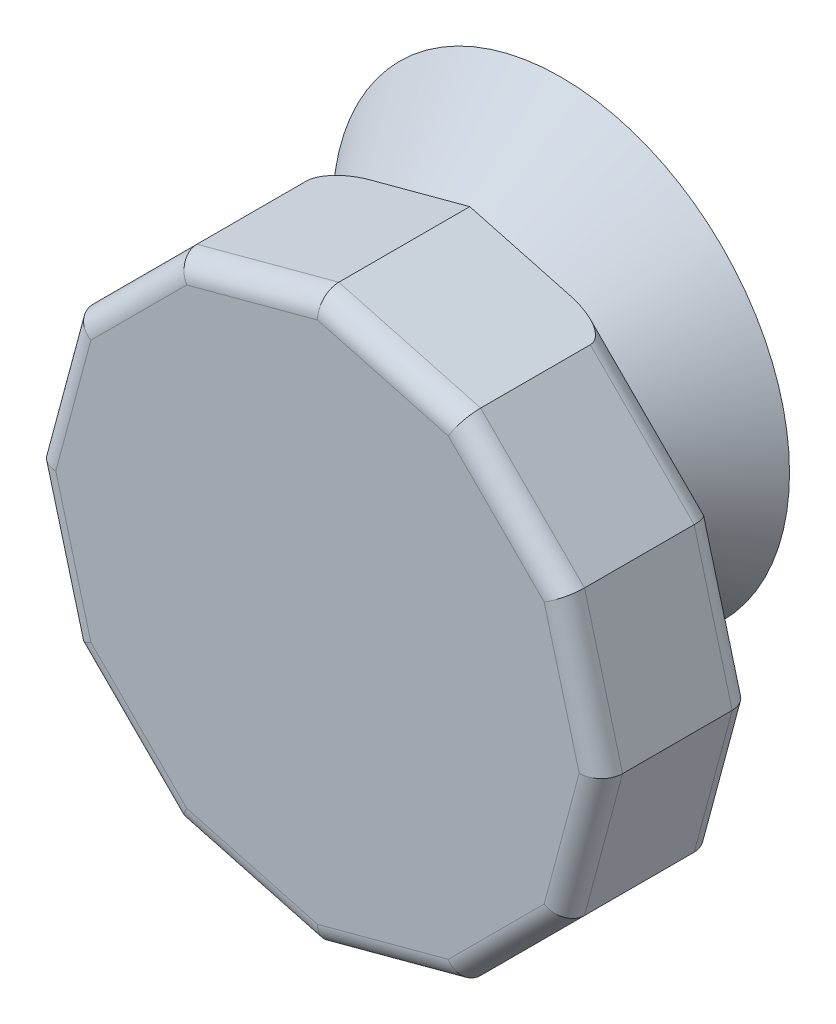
from build123d import *

# Parameters (mm, degrees)
BOSS_EXTRU_1_DEPTH      = 5
ESQUISSE7_W             = 10
ESQUISSE7_H             = 2
ENL_V_MAT_EXTRU_9_DEPTH = 4
ENL_V_MAT_EXTRU_9_DRAFT = -10
CONG_1_R                = 0.7


with BuildPart() as part:
    # Esquisse1 → Boss.-Extru.1 (new body)
    with BuildSketch(Plane.XY):
        Polygon((-8.06917925, 4.658742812), (-9.317485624, 0), (-8.06917925, -4.658742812), (-4.658742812, -8.06917925), (0, -9.317485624), (4.658742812, -8.06917925), (8.06917925, -4.658742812), (9.317485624, 0), (8.06917925, 4.658742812), (4.658742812, 8.06917925), (0, 9.317485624), (-4.658742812, 8.06917925), align=None)
    extrude(amount=BOSS_EXTRU_1_DEPTH)

    # Esquisse5 → R_volution1 (revolve)
    with BuildSketch(Plane(origin=(0, 0, 0), x_dir=(0, 0, -1), z_dir=(1, 0, 0)), mode=Mode.PRIVATE) as r_volution1_sk:
        Polygon((0, 4), (3, 4), (3, 11.5), (0, 9), align=None)
    revolve(r_volution1_sk.sketch.rotate(Axis((0, 4, -2.663455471), (0, 0, 1)), 90), axis=Axis((0, 4, -2.663455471), (0, 0, 1)))


with BuildPart() as enl_v_mat_extru_9_tool:
    # Esquisse7 → Enl_v. mat.-Extru.9 (with draft: the straight prism first)
    with BuildSketch(Plane(origin=(0, 0, -3), x_dir=(-1, 0, 0), z_dir=(0, 0, -1))):
        with Locations((0, 2)):
            Rectangle(ESQUISSE7_W, ESQUISSE7_H)
    extrude(amount=-ENL_V_MAT_EXTRU_9_DEPTH)
    # Enl_v. mat.-Extru.9: the draft: its side faces are tilted about the plane it starts from
    enl_v_mat_extru_9_sides = [enl_v_mat_extru_9_tool.faces().sort_by_distance(p)[0] for p in [
        (5, 2, -1),
        (0, 1, -1),
        (-5, 2, -1),
        (0, 3, -1),
    ]]
    draft(enl_v_mat_extru_9_sides, Plane(origin=(0, 0, -3), x_dir=(-1, 0, 0), z_dir=(0, 0, -1)), ENL_V_MAT_EXTRU_9_DRAFT)


with BuildPart() as part_1:
    add(part.part)

    # Enl_v. mat.-Extru.9: cut by enl_v_mat_extru_9_tool
    add(enl_v_mat_extru_9_tool.part, mode=Mode.SUBTRACT)

    # Cong_1
    cong_1_edges = [part_1.edges().sort_by_distance(p)[0] for p in [
        (-8.693332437, 2.329371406, 0),
        (-6.363961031, 6.363961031, 0),
        (-2.329371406, -8.693332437, 5),
        (6.363961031, 6.363961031, 0),
        (8.693332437, 2.329371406, 0),
        (8.693332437, -2.329371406, 0),
        (6.363961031, -6.363961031, 0),
        (2.329371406, -8.693332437, 0),
        (-2.329371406, -8.693332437, 0),
        (-6.363961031, -6.363961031, 0),
        (-8.693332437, -2.329371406, 0),
        (2.329371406, -8.693332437, 5),
        (6.363961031, -6.363961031, 5),
        (8.693332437, -2.329371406, 5),
        (8.693332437, 2.329371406, 5),
        (6.363961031, 6.363961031, 5),
        (2.329371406, 8.693332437, 5),
        (-2.329371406, 8.693332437, 5),
        (-6.363961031, 6.363961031, 5),
        (-8.693332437, 2.329371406, 5),
        (-8.693332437, -2.329371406, 5),
        (-6.363961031, -6.363961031, 5),
    ]]
    fillet(cong_1_edges, radius=CONG_1_R)


solid = part_1.part
